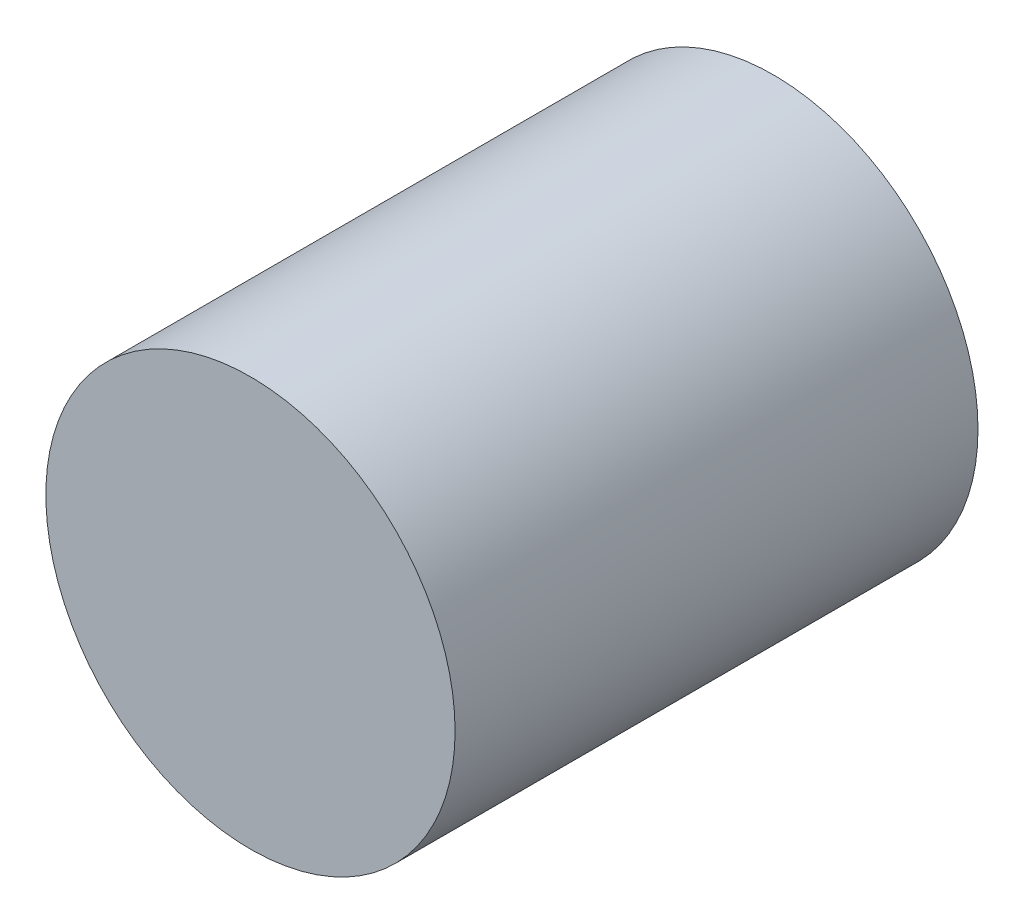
ISO-10303-21;
HEADER;
FILE_DESCRIPTION(('STEP AP214'),'2;1');
FILE_NAME('part.step','',(''),(''),'','','');
FILE_SCHEMA(('AUTOMOTIVE_DESIGN { 1 0 10303 214 1 1 1 1 }'));
ENDSEC;
DATA;
#1=APPLICATION_CONTEXT('core data for automotive mechanical design processes');
#2=APPLICATION_PROTOCOL_DEFINITION('international standard','automotive_design',2000,#1);
#3=PRODUCT_CONTEXT('',#1,'mechanical');
#4=PRODUCT('Part','Part','',(#3));
#5=PRODUCT_RELATED_PRODUCT_CATEGORY('part','',(#4));
#6=PRODUCT_DEFINITION_FORMATION('','',#4);
#7=PRODUCT_DEFINITION_CONTEXT('part definition',#1,'design');
#8=PRODUCT_DEFINITION('design','',#6,#7);
#9=PRODUCT_DEFINITION_SHAPE('','',#8);
#10=(LENGTH_UNIT() NAMED_UNIT(*) SI_UNIT(.MILLI.,.METRE.));
#11=(NAMED_UNIT(*) PLANE_ANGLE_UNIT() SI_UNIT($,.RADIAN.));
#12=(NAMED_UNIT(*) SI_UNIT($,.STERADIAN.) SOLID_ANGLE_UNIT());
#13=UNCERTAINTY_MEASURE_WITH_UNIT(LENGTH_MEASURE(1.E-05),#10,'distance_accuracy_value','');
#14=(GEOMETRIC_REPRESENTATION_CONTEXT(3) GLOBAL_UNCERTAINTY_ASSIGNED_CONTEXT((#13)) GLOBAL_UNIT_ASSIGNED_CONTEXT((#10,
#11,#12)) REPRESENTATION_CONTEXT('',''));
#15=CARTESIAN_POINT('',(0.,0.,0.));
#16=DIRECTION('',(0.,0.,1.));
#17=DIRECTION('',(1.,0.,0.));
#18=AXIS2_PLACEMENT_3D('',#15,#16,#17);
#19=CARTESIAN_POINT('',(0.,0.,23.));
#20=DIRECTION('',(0.,0.,-1.));
#21=DIRECTION('',(-1.,0.,0.));
#22=AXIS2_PLACEMENT_3D('',#19,#20,#21);
#23=CYLINDRICAL_SURFACE('',#22,9.);
#24=CARTESIAN_POINT('',(0.,0.,23.));
#25=DIRECTION('',(0.,0.,1.));
#26=DIRECTION('',(1.,0.,0.));
#27=AXIS2_PLACEMENT_3D('',#24,#25,#26);
#28=CIRCLE('',#27,9.);
#29=CARTESIAN_POINT('',(9.,0.,23.));
#30=VERTEX_POINT('',#29);
#31=EDGE_CURVE('E8',#30,#30,#28,.T.);
#32=ORIENTED_EDGE('',*,*,#31,.F.);
#33=EDGE_LOOP('',(#32));
#34=FACE_BOUND('',#33,.T.);
#35=CARTESIAN_POINT('',(0.,0.,0.));
#36=DIRECTION('',(0.,0.,1.));
#37=DIRECTION('',(1.,0.,0.));
#38=AXIS2_PLACEMENT_3D('',#35,#36,#37);
#39=CIRCLE('',#38,9.);
#40=CARTESIAN_POINT('',(9.,0.,0.));
#41=VERTEX_POINT('',#40);
#42=EDGE_CURVE('E15',#41,#41,#39,.T.);
#43=ORIENTED_EDGE('',*,*,#42,.T.);
#44=EDGE_LOOP('',(#43));
#45=FACE_BOUND('',#44,.T.);
#46=ADVANCED_FACE('F12',(#34,#45),#23,.T.);
#47=CARTESIAN_POINT('',(0.,0.,23.));
#48=DIRECTION('',(0.,0.,1.));
#49=DIRECTION('',(1.,0.,0.));
#50=AXIS2_PLACEMENT_3D('',#47,#48,#49);
#51=PLANE('',#50);
#52=ORIENTED_EDGE('',*,*,#31,.T.);
#53=EDGE_LOOP('',(#52));
#54=FACE_BOUND('',#53,.T.);
#55=ADVANCED_FACE('F27',(#54),#51,.T.);
#56=CARTESIAN_POINT('',(0.,0.,0.));
#57=DIRECTION('',(0.,0.,1.));
#58=DIRECTION('',(1.,0.,0.));
#59=AXIS2_PLACEMENT_3D('',#56,#57,#58);
#60=PLANE('',#59);
#61=ORIENTED_EDGE('',*,*,#42,.F.);
#62=EDGE_LOOP('',(#61));
#63=FACE_BOUND('',#62,.T.);
#64=ADVANCED_FACE('F25',(#63),#60,.F.);
#65=CLOSED_SHELL('',(#46,#55,#64));
#66=MANIFOLD_SOLID_BREP('B1',#65);
#67=ADVANCED_BREP_SHAPE_REPRESENTATION('',(#18,#66),#14);
#68=SHAPE_DEFINITION_REPRESENTATION(#9,#67);
ENDSEC;
END-ISO-10303-21;
